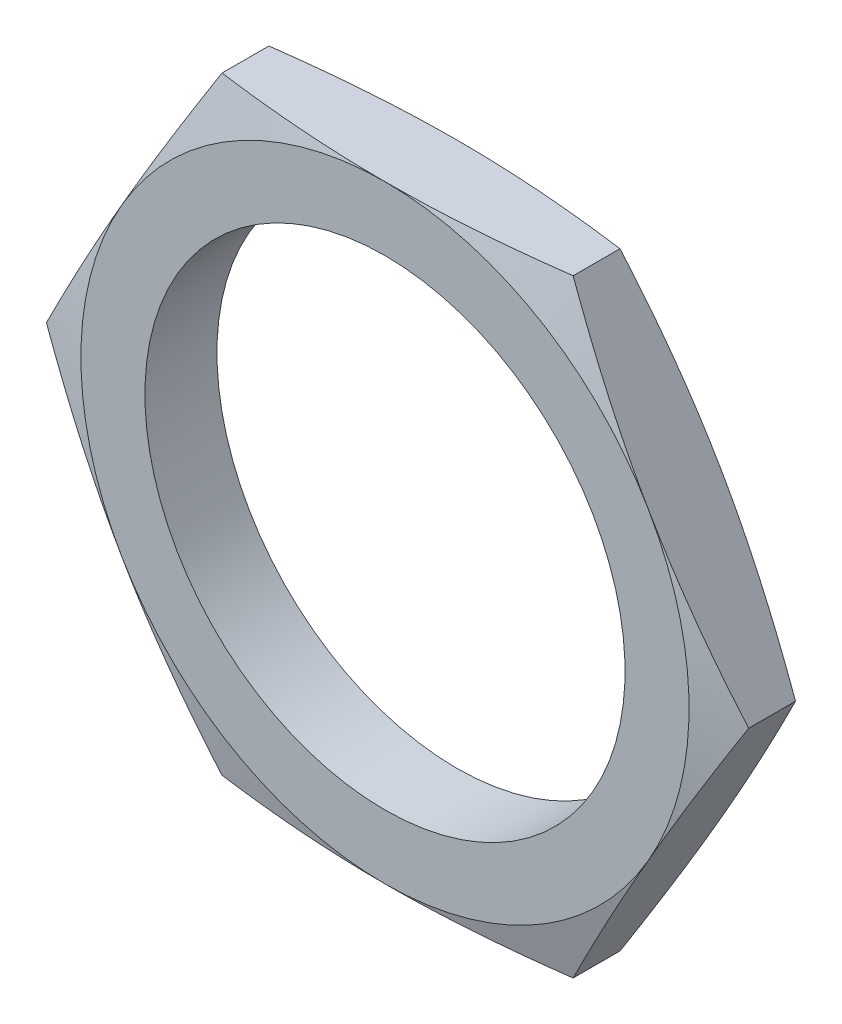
ISO-10303-21;
HEADER;
FILE_DESCRIPTION(('STEP AP214'),'2;1');
FILE_NAME('part.step','',(''),(''),'','','');
FILE_SCHEMA(('AUTOMOTIVE_DESIGN { 1 0 10303 214 1 1 1 1 }'));
ENDSEC;
DATA;
#1=APPLICATION_CONTEXT('core data for automotive mechanical design processes');
#2=APPLICATION_PROTOCOL_DEFINITION('international standard','automotive_design',2000,#1);
#3=PRODUCT_CONTEXT('',#1,'mechanical');
#4=PRODUCT('Part','Part','',(#3));
#5=PRODUCT_RELATED_PRODUCT_CATEGORY('part','',(#4));
#6=PRODUCT_DEFINITION_FORMATION('','',#4);
#7=PRODUCT_DEFINITION_CONTEXT('part definition',#1,'design');
#8=PRODUCT_DEFINITION('design','',#6,#7);
#9=PRODUCT_DEFINITION_SHAPE('','',#8);
#10=(LENGTH_UNIT() NAMED_UNIT(*) SI_UNIT(.MILLI.,.METRE.));
#11=(NAMED_UNIT(*) PLANE_ANGLE_UNIT() SI_UNIT($,.RADIAN.));
#12=(NAMED_UNIT(*) SI_UNIT($,.STERADIAN.) SOLID_ANGLE_UNIT());
#13=UNCERTAINTY_MEASURE_WITH_UNIT(LENGTH_MEASURE(1.E-05),#10,'distance_accuracy_value','');
#14=(GEOMETRIC_REPRESENTATION_CONTEXT(3) GLOBAL_UNCERTAINTY_ASSIGNED_CONTEXT((#13)) GLOBAL_UNIT_ASSIGNED_CONTEXT((#10,
#11,#12)) REPRESENTATION_CONTEXT('',''));
#15=CARTESIAN_POINT('',(0.,0.,0.));
#16=DIRECTION('',(0.,0.,1.));
#17=DIRECTION('',(1.,0.,0.));
#18=AXIS2_PLACEMENT_3D('',#15,#16,#17);
#19=CARTESIAN_POINT('',(60.,295.,13.));
#20=DIRECTION('',(0.,0.,1.));
#21=DIRECTION('',(0.,-1.,0.));
#22=AXIS2_PLACEMENT_3D('',#19,#20,#21);
#23=PLANE('',#22);
#24=CARTESIAN_POINT('',(60.,295.,13.));
#25=DIRECTION('',(0.,0.,-1.));
#26=DIRECTION('',(0.,1.,0.));
#27=AXIS2_PLACEMENT_3D('',#24,#25,#26);
#28=CIRCLE('',#27,7.60000000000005);
#29=CARTESIAN_POINT('',(60.,302.6,13.));
#30=VERTEX_POINT('',#29);
#31=CARTESIAN_POINT('',(53.4182069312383,298.8,13.));
#32=VERTEX_POINT('',#31);
#33=EDGE_CURVE('E158',#30,#32,#28,.F.);
#34=ORIENTED_EDGE('',*,*,#33,.T.);
#35=CARTESIAN_POINT('',(60.,295.,13.));
#36=DIRECTION('',(0.,0.,-1.));
#37=DIRECTION('',(0.,1.,0.));
#38=AXIS2_PLACEMENT_3D('',#35,#36,#37);
#39=CIRCLE('',#38,7.6);
#40=CARTESIAN_POINT('',(53.4182069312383,291.2,13.));
#41=VERTEX_POINT('',#40);
#42=EDGE_CURVE('E154',#32,#41,#39,.F.);
#43=ORIENTED_EDGE('',*,*,#42,.T.);
#44=CARTESIAN_POINT('',(60.,295.,13.));
#45=DIRECTION('',(0.,0.,-1.));
#46=DIRECTION('',(0.,1.,0.));
#47=AXIS2_PLACEMENT_3D('',#44,#45,#46);
#48=CIRCLE('',#47,7.59999999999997);
#49=CARTESIAN_POINT('',(60.,287.4,13.));
#50=VERTEX_POINT('',#49);
#51=EDGE_CURVE('E143',#41,#50,#48,.F.);
#52=ORIENTED_EDGE('',*,*,#51,.T.);
#53=CARTESIAN_POINT('',(60.,295.,13.));
#54=DIRECTION('',(0.,0.,-1.));
#55=DIRECTION('',(0.,1.,0.));
#56=AXIS2_PLACEMENT_3D('',#53,#54,#55);
#57=CIRCLE('',#56,7.6);
#58=CARTESIAN_POINT('',(66.5817930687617,291.2,13.));
#59=VERTEX_POINT('',#58);
#60=EDGE_CURVE('E149',#50,#59,#57,.F.);
#61=ORIENTED_EDGE('',*,*,#60,.T.);
#62=CARTESIAN_POINT('',(60.,295.,13.));
#63=DIRECTION('',(0.,0.,-1.));
#64=DIRECTION('',(0.,1.,0.));
#65=AXIS2_PLACEMENT_3D('',#62,#63,#64);
#66=CIRCLE('',#65,7.59999999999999);
#67=CARTESIAN_POINT('',(66.5817930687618,298.8,13.));
#68=VERTEX_POINT('',#67);
#69=EDGE_CURVE('E519',#59,#68,#66,.F.);
#70=ORIENTED_EDGE('',*,*,#69,.T.);
#71=CARTESIAN_POINT('',(60.,295.,13.));
#72=DIRECTION('',(0.,0.,-1.));
#73=DIRECTION('',(0.,1.,0.));
#74=AXIS2_PLACEMENT_3D('',#71,#72,#73);
#75=CIRCLE('',#74,7.59999999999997);
#76=EDGE_CURVE('E522',#68,#30,#75,.F.);
#77=ORIENTED_EDGE('',*,*,#76,.T.);
#78=EDGE_LOOP('',(#34,#43,#52,#61,#70,#77));
#79=FACE_BOUND('',#78,.T.);
#80=CARTESIAN_POINT('',(60.,295.,13.));
#81=DIRECTION('',(0.,0.,-1.));
#82=DIRECTION('',(0.,1.,0.));
#83=AXIS2_PLACEMENT_3D('',#80,#81,#82);
#84=CIRCLE('',#83,6.00000000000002);
#85=CARTESIAN_POINT('',(60.,301.,13.));
#86=VERTEX_POINT('',#85);
#87=EDGE_CURVE('E168',#86,#86,#84,.T.);
#88=ORIENTED_EDGE('',*,*,#87,.T.);
#89=EDGE_LOOP('',(#88));
#90=FACE_BOUND('',#89,.T.);
#91=ADVANCED_FACE('F38',(#79,#90),#23,.T.);
#92=CARTESIAN_POINT('',(60.,295.,13.));
#93=DIRECTION('',(0.,0.,-1.));
#94=DIRECTION('',(0.,1.,0.));
#95=AXIS2_PLACEMENT_3D('',#92,#93,#94);
#96=CONICAL_SURFACE('',#95,7.59999999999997,1.30899693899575);
#97=ORIENTED_EDGE('',*,*,#51,.F.);
#98=CARTESIAN_POINT('',(55.6121379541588,287.4,12.6849656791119));
#99=CARTESIAN_POINT('',(55.4302674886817,287.715008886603,12.7337204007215));
#100=CARTESIAN_POINT('',(55.2480606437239,288.030600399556,12.7779857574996));
#101=CARTESIAN_POINT('',(54.8832861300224,288.662408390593,12.8557208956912));
#102=CARTESIAN_POINT('',(54.7007191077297,288.978623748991,12.889202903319));
#103=CARTESIAN_POINT('',(54.4264957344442,289.453592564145,12.9300596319));
#104=CARTESIAN_POINT('',(54.3350130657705,289.612045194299,12.9421185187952));
#105=CARTESIAN_POINT('',(54.1519535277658,289.929113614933,12.9629380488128));
#106=CARTESIAN_POINT('',(54.0603766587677,290.087729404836,12.9716987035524));
#107=CARTESIAN_POINT('',(53.8770530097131,290.405255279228,12.9857840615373));
#108=CARTESIAN_POINT('',(53.7853061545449,290.564165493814,12.9911048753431));
#109=CARTESIAN_POINT('',(53.6017754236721,290.882050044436,12.9982181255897));
#110=CARTESIAN_POINT('',(53.5099915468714,291.04102438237,13.0000104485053));
#111=CARTESIAN_POINT('',(53.4182069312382,291.2,13.));
#112=B_SPLINE_CURVE_WITH_KNOTS('',3,(#98,#99,#100,#101,#102,#103,#104,#105,#106,#107,#108,#109,
#110,#111),.UNSPECIFIED.,.F.,.F.,(4,2,2,2,2,2,4),(0.,1.10106684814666,2.20088087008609,
2.7509407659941,3.30099872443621,3.85167755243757,4.40237409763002),.UNSPECIFIED.);
#113=CARTESIAN_POINT('',(55.6121379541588,287.4,12.6849656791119));
#114=VERTEX_POINT('',#113);
#115=EDGE_CURVE('E131',#114,#41,#112,.T.);
#116=ORIENTED_EDGE('',*,*,#115,.F.);
#117=CARTESIAN_POINT('',(60.,287.4,13.));
#118=CARTESIAN_POINT('',(59.8164307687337,287.4,13.0000104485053));
#119=CARTESIAN_POINT('',(59.6328630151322,287.4,12.9982181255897));
#120=CARTESIAN_POINT('',(59.2658015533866,287.4,12.9911048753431));
#121=CARTESIAN_POINT('',(59.0823078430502,287.4,12.9857840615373));
#122=CARTESIAN_POINT('',(58.7156605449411,287.4,12.9716987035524));
#123=CARTESIAN_POINT('',(58.5325068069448,287.4,12.9629380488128));
#124=CARTESIAN_POINT('',(58.1663877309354,287.4,12.9421185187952));
#125=CARTESIAN_POINT('',(57.9834223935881,287.4,12.9300596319));
#126=CARTESIAN_POINT('',(57.434975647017,287.4,12.889202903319));
#127=CARTESIAN_POINT('',(57.0698416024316,287.4,12.8557208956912));
#128=CARTESIAN_POINT('',(56.3402925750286,287.4,12.7779857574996));
#129=CARTESIAN_POINT('',(55.9758788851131,287.4,12.7337204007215));
#130=CARTESIAN_POINT('',(55.6121379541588,287.4,12.6849656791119));
#131=B_SPLINE_CURVE_WITH_KNOTS('',3,(#117,#118,#119,#120,#121,#122,#123,#124,#125,#126,#127,
#128,#129,#130),.UNSPECIFIED.,.F.,.F.,(4,2,2,2,2,2,4),(0.,0.550696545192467,1.10137537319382,
1.65143333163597,2.201493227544,3.30130724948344,4.40237409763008),.UNSPECIFIED.);
#132=EDGE_CURVE('E145',#50,#114,#131,.T.);
#133=ORIENTED_EDGE('',*,*,#132,.F.);
#134=EDGE_LOOP('',(#97,#116,#133));
#135=FACE_BOUND('',#134,.T.);
#136=ADVANCED_FACE('F40',(#135),#96,.T.);
#137=CARTESIAN_POINT('',(60.,295.,13.));
#138=DIRECTION('',(0.,0.,-1.));
#139=DIRECTION('',(0.,1.,0.));
#140=AXIS2_PLACEMENT_3D('',#137,#138,#139);
#141=CONICAL_SURFACE('',#140,7.59999999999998,1.30899693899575);
#142=ORIENTED_EDGE('',*,*,#60,.F.);
#143=CARTESIAN_POINT('',(64.3878620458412,287.4,12.6849656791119));
#144=CARTESIAN_POINT('',(64.0241211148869,287.4,12.7337204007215));
#145=CARTESIAN_POINT('',(63.6597074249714,287.4,12.7779857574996));
#146=CARTESIAN_POINT('',(62.9301583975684,287.4,12.8557208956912));
#147=CARTESIAN_POINT('',(62.565024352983,287.4,12.889202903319));
#148=CARTESIAN_POINT('',(62.0165776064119,287.4,12.9300596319));
#149=CARTESIAN_POINT('',(61.8336122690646,287.4,12.9421185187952));
#150=CARTESIAN_POINT('',(61.4674931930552,287.4,12.9629380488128));
#151=CARTESIAN_POINT('',(61.2843394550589,287.4,12.9716987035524));
#152=CARTESIAN_POINT('',(60.9176921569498,287.4,12.9857840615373));
#153=CARTESIAN_POINT('',(60.7341984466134,287.4,12.9911048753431));
#154=CARTESIAN_POINT('',(60.3671369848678,287.4,12.9982181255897));
#155=CARTESIAN_POINT('',(60.1835692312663,287.4,13.0000104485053));
#156=CARTESIAN_POINT('',(60.,287.4,13.));
#157=B_SPLINE_CURVE_WITH_KNOTS('',3,(#143,#144,#145,#146,#147,#148,#149,#150,#151,#152,#153,
#154,#155,#156),.UNSPECIFIED.,.F.,.F.,(4,2,2,2,2,2,4),(0.,1.10106684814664,2.20088087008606,
2.7509407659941,3.30099872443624,3.85167755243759,4.40237409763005),.UNSPECIFIED.);
#158=CARTESIAN_POINT('',(64.3878620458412,287.4,12.6849656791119));
#159=VERTEX_POINT('',#158);
#160=EDGE_CURVE('E141',#159,#50,#157,.T.);
#161=ORIENTED_EDGE('',*,*,#160,.F.);
#162=CARTESIAN_POINT('',(66.5817930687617,291.2,13.));
#163=CARTESIAN_POINT('',(66.4900084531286,291.04102438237,13.0000104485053));
#164=CARTESIAN_POINT('',(66.3982245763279,290.882050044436,12.9982181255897));
#165=CARTESIAN_POINT('',(66.2146938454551,290.564165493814,12.9911048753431));
#166=CARTESIAN_POINT('',(66.1229469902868,290.405255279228,12.9857840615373));
#167=CARTESIAN_POINT('',(65.9396233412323,290.087729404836,12.9716987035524));
#168=CARTESIAN_POINT('',(65.8480464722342,289.929113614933,12.9629380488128));
#169=CARTESIAN_POINT('',(65.6649869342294,289.612045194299,12.9421185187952));
#170=CARTESIAN_POINT('',(65.5735042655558,289.453592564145,12.9300596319));
#171=CARTESIAN_POINT('',(65.2992808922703,288.978623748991,12.889202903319));
#172=CARTESIAN_POINT('',(65.1167138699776,288.662408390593,12.8557208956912));
#173=CARTESIAN_POINT('',(64.7519393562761,288.030600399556,12.7779857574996));
#174=CARTESIAN_POINT('',(64.5697325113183,287.715008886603,12.7337204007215));
#175=CARTESIAN_POINT('',(64.3878620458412,287.4,12.6849656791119));
#176=B_SPLINE_CURVE_WITH_KNOTS('',3,(#162,#163,#164,#165,#166,#167,#168,#169,#170,#171,#172,
#173,#174,#175),.UNSPECIFIED.,.F.,.F.,(4,2,2,2,2,2,4),(0.,0.550696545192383,1.10137537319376,
1.65143333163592,2.20149322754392,3.30130724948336,4.40237409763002),.UNSPECIFIED.);
#177=EDGE_CURVE('E199',#59,#159,#176,.T.);
#178=ORIENTED_EDGE('',*,*,#177,.F.);
#179=EDGE_LOOP('',(#142,#161,#178));
#180=FACE_BOUND('',#179,.T.);
#181=ADVANCED_FACE('F484',(#180),#141,.T.);
#182=CARTESIAN_POINT('',(60.,295.,13.));
#183=DIRECTION('',(0.,0.,-1.));
#184=DIRECTION('',(0.,1.,0.));
#185=AXIS2_PLACEMENT_3D('',#182,#183,#184);
#186=CONICAL_SURFACE('',#185,7.59999999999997,1.30899693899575);
#187=ORIENTED_EDGE('',*,*,#69,.F.);
#188=CARTESIAN_POINT('',(68.7757240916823,295.,12.6849656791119));
#189=CARTESIAN_POINT('',(68.5938536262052,294.684991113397,12.7337204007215));
#190=CARTESIAN_POINT('',(68.4116467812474,294.369399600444,12.7779857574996));
#191=CARTESIAN_POINT('',(68.0468722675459,293.737591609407,12.8557208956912));
#192=CARTESIAN_POINT('',(67.8643052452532,293.421376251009,12.889202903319));
#193=CARTESIAN_POINT('',(67.5900818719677,292.946407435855,12.9300596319));
#194=CARTESIAN_POINT('',(67.498599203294,292.787954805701,12.9421185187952));
#195=CARTESIAN_POINT('',(67.3155396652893,292.470886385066,12.9629380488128));
#196=CARTESIAN_POINT('',(67.2239627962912,292.312270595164,12.9716987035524));
#197=CARTESIAN_POINT('',(67.0406391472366,291.994744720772,12.9857840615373));
#198=CARTESIAN_POINT('',(66.9488922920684,291.835834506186,12.9911048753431));
#199=CARTESIAN_POINT('',(66.7653615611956,291.517949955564,12.9982181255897));
#200=CARTESIAN_POINT('',(66.6735776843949,291.35897561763,13.0000104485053));
#201=CARTESIAN_POINT('',(66.5817930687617,291.2,13.));
#202=B_SPLINE_CURVE_WITH_KNOTS('',3,(#188,#189,#190,#191,#192,#193,#194,#195,#196,#197,#198,
#199,#200,#201),.UNSPECIFIED.,.F.,.F.,(4,2,2,2,2,2,4),(0.,1.1010668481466,2.2008808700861,
2.7509407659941,3.30099872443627,3.85167755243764,4.40237409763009),.UNSPECIFIED.);
#203=CARTESIAN_POINT('',(68.7757240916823,295.,12.6849656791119));
#204=VERTEX_POINT('',#203);
#205=EDGE_CURVE('E201',#204,#59,#202,.T.);
#206=ORIENTED_EDGE('',*,*,#205,.F.);
#207=CARTESIAN_POINT('',(66.5817930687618,298.8,13.));
#208=CARTESIAN_POINT('',(66.673577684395,298.64102438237,13.0000104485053));
#209=CARTESIAN_POINT('',(66.7653615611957,298.482050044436,12.9982181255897));
#210=CARTESIAN_POINT('',(66.9488922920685,298.164165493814,12.9911048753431));
#211=CARTESIAN_POINT('',(67.0406391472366,298.005255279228,12.9857840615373));
#212=CARTESIAN_POINT('',(67.2239627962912,297.687729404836,12.9716987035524));
#213=CARTESIAN_POINT('',(67.3155396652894,297.529113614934,12.9629380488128));
#214=CARTESIAN_POINT('',(67.4985992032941,297.212045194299,12.9421185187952));
#215=CARTESIAN_POINT('',(67.5900818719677,297.053592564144,12.9300596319));
#216=CARTESIAN_POINT('',(67.8643052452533,296.578623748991,12.889202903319));
#217=CARTESIAN_POINT('',(68.046872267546,296.262408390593,12.8557208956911));
#218=CARTESIAN_POINT('',(68.4116467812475,295.630600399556,12.7779857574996));
#219=CARTESIAN_POINT('',(68.5938536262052,295.315008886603,12.7337204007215));
#220=CARTESIAN_POINT('',(68.7757240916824,295.,12.6849656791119));
#221=B_SPLINE_CURVE_WITH_KNOTS('',3,(#207,#208,#209,#210,#211,#212,#213,#214,#215,#216,#217,
#218,#219,#220),.UNSPECIFIED.,.F.,.F.,(4,2,2,2,2,2,4),(0.,0.550696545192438,1.1013753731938,
1.65143333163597,2.20149322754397,3.30130724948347,4.40237409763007),.UNSPECIFIED.);
#222=EDGE_CURVE('E194',#68,#204,#221,.T.);
#223=ORIENTED_EDGE('',*,*,#222,.F.);
#224=EDGE_LOOP('',(#187,#206,#223));
#225=FACE_BOUND('',#224,.T.);
#226=ADVANCED_FACE('F333',(#225),#186,.T.);
#227=CARTESIAN_POINT('',(60.,295.,13.));
#228=DIRECTION('',(0.,0.,-1.));
#229=DIRECTION('',(0.,1.,0.));
#230=AXIS2_PLACEMENT_3D('',#227,#228,#229);
#231=CONICAL_SURFACE('',#230,7.59999999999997,1.30899693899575);
#232=CARTESIAN_POINT('',(60.,302.6,13.));
#233=CARTESIAN_POINT('',(60.1835692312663,302.6,13.0000104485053));
#234=CARTESIAN_POINT('',(60.3671369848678,302.6,12.9982181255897));
#235=CARTESIAN_POINT('',(60.7341984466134,302.6,12.9911048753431));
#236=CARTESIAN_POINT('',(60.9176921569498,302.6,12.9857840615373));
#237=CARTESIAN_POINT('',(61.2843394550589,302.6,12.9716987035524));
#238=CARTESIAN_POINT('',(61.4674931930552,302.6,12.9629380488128));
#239=CARTESIAN_POINT('',(61.8336122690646,302.6,12.9421185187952));
#240=CARTESIAN_POINT('',(62.0165776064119,302.6,12.9300596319));
#241=CARTESIAN_POINT('',(62.565024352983,302.6,12.889202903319));
#242=CARTESIAN_POINT('',(62.9301583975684,302.6,12.8557208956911));
#243=CARTESIAN_POINT('',(63.6597074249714,302.6,12.7779857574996));
#244=CARTESIAN_POINT('',(64.0241211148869,302.6,12.7337204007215));
#245=CARTESIAN_POINT('',(64.3878620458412,302.6,12.6849656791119));
#246=B_SPLINE_CURVE_WITH_KNOTS('',3,(#232,#233,#234,#235,#236,#237,#238,#239,#240,#241,#242,
#243,#244,#245),.UNSPECIFIED.,.F.,.F.,(4,2,2,2,2,2,4),(0.,0.550696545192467,1.10137537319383,
1.65143333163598,2.20149322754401,3.30130724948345,4.4023740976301),.UNSPECIFIED.);
#247=CARTESIAN_POINT('',(64.3878620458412,302.6,12.6849656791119));
#248=VERTEX_POINT('',#247);
#249=EDGE_CURVE('E186',#30,#248,#246,.T.);
#250=ORIENTED_EDGE('',*,*,#249,.F.);
#251=ORIENTED_EDGE('',*,*,#76,.F.);
#252=CARTESIAN_POINT('',(64.3878620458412,302.6,12.6849656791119));
#253=CARTESIAN_POINT('',(64.5697325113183,302.284991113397,12.7337204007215));
#254=CARTESIAN_POINT('',(64.7519393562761,301.969399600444,12.7779857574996));
#255=CARTESIAN_POINT('',(65.1167138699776,301.337591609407,12.8557208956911));
#256=CARTESIAN_POINT('',(65.2992808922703,301.021376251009,12.889202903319));
#257=CARTESIAN_POINT('',(65.5735042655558,300.546407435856,12.9300596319));
#258=CARTESIAN_POINT('',(65.6649869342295,300.387954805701,12.9421185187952));
#259=CARTESIAN_POINT('',(65.8480464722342,300.070886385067,12.9629380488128));
#260=CARTESIAN_POINT('',(65.9396233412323,299.912270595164,12.9716987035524));
#261=CARTESIAN_POINT('',(66.1229469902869,299.594744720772,12.9857840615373));
#262=CARTESIAN_POINT('',(66.2146938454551,299.435834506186,12.9911048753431));
#263=CARTESIAN_POINT('',(66.3982245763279,299.117949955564,12.9982181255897));
#264=CARTESIAN_POINT('',(66.4900084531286,298.95897561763,13.0000104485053));
#265=CARTESIAN_POINT('',(66.5817930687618,298.8,13.));
#266=B_SPLINE_CURVE_WITH_KNOTS('',3,(#252,#253,#254,#255,#256,#257,#258,#259,#260,#261,#262,
#263,#264,#265),.UNSPECIFIED.,.F.,.F.,(4,2,2,2,2,2,4),(0.,1.10106684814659,2.20088087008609,
2.7509407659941,3.30099872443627,3.85167755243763,4.40237409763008),.UNSPECIFIED.);
#267=EDGE_CURVE('E198',#248,#68,#266,.T.);
#268=ORIENTED_EDGE('',*,*,#267,.F.);
#269=EDGE_LOOP('',(#250,#251,#268));
#270=FACE_BOUND('',#269,.T.);
#271=ADVANCED_FACE('F329',(#270),#231,.T.);
#272=CARTESIAN_POINT('',(60.,295.,13.));
#273=DIRECTION('',(0.,0.,-1.));
#274=DIRECTION('',(0.,1.,0.));
#275=AXIS2_PLACEMENT_3D('',#272,#273,#274);
#276=CONICAL_SURFACE('',#275,7.6,1.30899693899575);
#277=CARTESIAN_POINT('',(53.4182069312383,298.8,13.));
#278=CARTESIAN_POINT('',(53.5099915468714,298.95897561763,13.0000104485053));
#279=CARTESIAN_POINT('',(53.6017754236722,299.117949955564,12.9982181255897));
#280=CARTESIAN_POINT('',(53.785306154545,299.435834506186,12.9911048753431));
#281=CARTESIAN_POINT('',(53.8770530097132,299.594744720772,12.9857840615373));
#282=CARTESIAN_POINT('',(54.0603766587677,299.912270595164,12.9716987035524));
#283=CARTESIAN_POINT('',(54.1519535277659,300.070886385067,12.9629380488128));
#284=CARTESIAN_POINT('',(54.3350130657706,300.387954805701,12.9421185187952));
#285=CARTESIAN_POINT('',(54.4264957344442,300.546407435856,12.9300596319));
#286=CARTESIAN_POINT('',(54.7007191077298,301.021376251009,12.889202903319));
#287=CARTESIAN_POINT('',(54.8832861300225,301.337591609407,12.8557208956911));
#288=CARTESIAN_POINT('',(55.248060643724,301.969399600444,12.7779857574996));
#289=CARTESIAN_POINT('',(55.4302674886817,302.284991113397,12.7337204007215));
#290=CARTESIAN_POINT('',(55.6121379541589,302.6,12.6849656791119));
#291=B_SPLINE_CURVE_WITH_KNOTS('',3,(#277,#278,#279,#280,#281,#282,#283,#284,#285,#286,#287,
#288,#289,#290),.UNSPECIFIED.,.F.,.F.,(4,2,2,2,2,2,4),(0.,0.550696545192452,1.10137537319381,
1.65143333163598,2.20149322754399,3.30130724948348,4.40237409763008),.UNSPECIFIED.);
#292=CARTESIAN_POINT('',(55.6121379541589,302.6,12.6849656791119));
#293=VERTEX_POINT('',#292);
#294=EDGE_CURVE('E190',#32,#293,#291,.T.);
#295=ORIENTED_EDGE('',*,*,#294,.F.);
#296=ORIENTED_EDGE('',*,*,#33,.F.);
#297=CARTESIAN_POINT('',(55.6121379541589,302.6,12.6849656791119));
#298=CARTESIAN_POINT('',(55.9758788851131,302.6,12.7337204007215));
#299=CARTESIAN_POINT('',(56.3402925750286,302.6,12.7779857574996));
#300=CARTESIAN_POINT('',(57.0698416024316,302.6,12.8557208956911));
#301=CARTESIAN_POINT('',(57.4349756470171,302.6,12.889202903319));
#302=CARTESIAN_POINT('',(57.9834223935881,302.6,12.9300596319));
#303=CARTESIAN_POINT('',(58.1663877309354,302.6,12.9421185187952));
#304=CARTESIAN_POINT('',(58.5325068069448,302.6,12.9629380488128));
#305=CARTESIAN_POINT('',(58.7156605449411,302.6,12.9716987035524));
#306=CARTESIAN_POINT('',(59.0823078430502,302.6,12.9857840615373));
#307=CARTESIAN_POINT('',(59.2658015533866,302.6,12.991104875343));
#308=CARTESIAN_POINT('',(59.6328630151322,302.6,12.9982181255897));
#309=CARTESIAN_POINT('',(59.8164307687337,302.6,13.0000104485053));
#310=CARTESIAN_POINT('',(60.,302.6,13.));
#311=B_SPLINE_CURVE_WITH_KNOTS('',3,(#297,#298,#299,#300,#301,#302,#303,#304,#305,#306,#307,
#308,#309,#310),.UNSPECIFIED.,.F.,.F.,(4,2,2,2,2,2,4),(0.,1.10106684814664,2.20088087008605,
2.75094076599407,3.30099872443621,3.85167755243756,4.40237409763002),.UNSPECIFIED.);
#312=EDGE_CURVE('E150',#293,#30,#311,.T.);
#313=ORIENTED_EDGE('',*,*,#312,.F.);
#314=EDGE_LOOP('',(#295,#296,#313));
#315=FACE_BOUND('',#314,.T.);
#316=ADVANCED_FACE('F332',(#315),#276,.T.);
#317=CARTESIAN_POINT('',(60.,295.,13.));
#318=DIRECTION('',(0.,0.,-1.));
#319=DIRECTION('',(0.,1.,0.));
#320=AXIS2_PLACEMENT_3D('',#317,#318,#319);
#321=CONICAL_SURFACE('',#320,7.59999999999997,1.30899693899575);
#322=CARTESIAN_POINT('',(53.4182069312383,291.2,13.));
#323=CARTESIAN_POINT('',(53.3264223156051,291.35897561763,13.0000104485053));
#324=CARTESIAN_POINT('',(53.2346384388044,291.517949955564,12.9982181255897));
#325=CARTESIAN_POINT('',(53.0511077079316,291.835834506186,12.9911048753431));
#326=CARTESIAN_POINT('',(52.9593608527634,291.994744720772,12.9857840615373));
#327=CARTESIAN_POINT('',(52.7760372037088,292.312270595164,12.9716987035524));
#328=CARTESIAN_POINT('',(52.6844603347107,292.470886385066,12.9629380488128));
#329=CARTESIAN_POINT('',(52.501400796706,292.787954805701,12.9421185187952));
#330=CARTESIAN_POINT('',(52.4099181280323,292.946407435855,12.9300596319));
#331=CARTESIAN_POINT('',(52.1356947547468,293.421376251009,12.889202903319));
#332=CARTESIAN_POINT('',(51.953127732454,293.737591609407,12.8557208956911));
#333=CARTESIAN_POINT('',(51.5883532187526,294.369399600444,12.7779857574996));
#334=CARTESIAN_POINT('',(51.4061463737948,294.684991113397,12.7337204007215));
#335=CARTESIAN_POINT('',(51.2242759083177,295.,12.6849656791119));
#336=B_SPLINE_CURVE_WITH_KNOTS('',3,(#322,#323,#324,#325,#326,#327,#328,#329,#330,#331,#332,
#333,#334,#335),.UNSPECIFIED.,.F.,.F.,(4,2,2,2,2,2,4),(0.,0.550696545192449,1.10137537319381,
1.65143333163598,2.20149322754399,3.30130724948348,4.40237409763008),.UNSPECIFIED.);
#337=CARTESIAN_POINT('',(51.2242759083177,295.,12.6849656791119));
#338=VERTEX_POINT('',#337);
#339=EDGE_CURVE('E43',#41,#338,#336,.T.);
#340=ORIENTED_EDGE('',*,*,#339,.F.);
#341=ORIENTED_EDGE('',*,*,#42,.F.);
#342=CARTESIAN_POINT('',(51.2242759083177,295.,12.6849656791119));
#343=CARTESIAN_POINT('',(51.4061463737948,295.315008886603,12.7337204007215));
#344=CARTESIAN_POINT('',(51.5883532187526,295.630600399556,12.7779857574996));
#345=CARTESIAN_POINT('',(51.9531277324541,296.262408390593,12.8557208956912));
#346=CARTESIAN_POINT('',(52.1356947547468,296.578623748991,12.889202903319));
#347=CARTESIAN_POINT('',(52.4099181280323,297.053592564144,12.9300596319));
#348=CARTESIAN_POINT('',(52.501400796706,297.212045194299,12.9421185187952));
#349=CARTESIAN_POINT('',(52.6844603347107,297.529113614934,12.9629380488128));
#350=CARTESIAN_POINT('',(52.7760372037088,297.687729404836,12.9716987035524));
#351=CARTESIAN_POINT('',(52.9593608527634,298.005255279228,12.9857840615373));
#352=CARTESIAN_POINT('',(53.0511077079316,298.164165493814,12.9911048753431));
#353=CARTESIAN_POINT('',(53.2346384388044,298.482050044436,12.9982181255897));
#354=CARTESIAN_POINT('',(53.3264223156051,298.64102438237,13.0000104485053));
#355=CARTESIAN_POINT('',(53.4182069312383,298.8,13.));
#356=B_SPLINE_CURVE_WITH_KNOTS('',3,(#342,#343,#344,#345,#346,#347,#348,#349,#350,#351,#352,
#353,#354,#355),.UNSPECIFIED.,.F.,.F.,(4,2,2,2,2,2,4),(0.,1.1010668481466,2.20088087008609,
2.75094076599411,3.30099872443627,3.85167755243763,4.40237409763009),.UNSPECIFIED.);
#357=EDGE_CURVE('E166',#338,#32,#356,.T.);
#358=ORIENTED_EDGE('',*,*,#357,.F.);
#359=EDGE_LOOP('',(#340,#341,#358));
#360=FACE_BOUND('',#359,.T.);
#361=ADVANCED_FACE('F165',(#360),#321,.T.);
#362=CARTESIAN_POINT('',(55.6121379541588,287.4,11.1999999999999));
#363=DIRECTION('',(-0.866025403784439,-0.5,0.));
#364=DIRECTION('',(0.5,-0.866025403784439,0.));
#365=AXIS2_PLACEMENT_3D('',#362,#363,#364);
#366=PLANE('',#365);
#367=DIRECTION('',(0.,0.,1.));
#368=VECTOR('',#367,1.);
#369=CARTESIAN_POINT('',(55.6121379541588,287.4,11.1999999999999));
#370=LINE('',#369,#368);
#371=CARTESIAN_POINT('',(55.6121379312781,287.4,11.5150343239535));
#372=VERTEX_POINT('',#371);
#373=EDGE_CURVE('E137',#114,#372,#370,.F.);
#374=ORIENTED_EDGE('',*,*,#373,.F.);
#375=ORIENTED_EDGE('',*,*,#115,.T.);
#376=ORIENTED_EDGE('',*,*,#339,.T.);
#377=DIRECTION('',(0.,0.,1.));
#378=VECTOR('',#377,1.);
#379=CARTESIAN_POINT('',(51.2242759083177,295.,11.1999999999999));
#380=LINE('',#379,#378);
#381=CARTESIAN_POINT('',(51.2242758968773,295.000000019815,11.5150343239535));
#382=VERTEX_POINT('',#381);
#383=EDGE_CURVE('E187',#382,#338,#380,.T.);
#384=ORIENTED_EDGE('',*,*,#383,.F.);
#385=CARTESIAN_POINT('',(51.224275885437,295.00000003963,11.5150343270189));
#386=CARTESIAN_POINT('',(51.4061463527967,294.684991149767,11.4662796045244));
#387=CARTESIAN_POINT('',(51.5883531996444,294.36939963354,11.4220142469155));
#388=CARTESIAN_POINT('',(51.953127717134,293.737591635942,11.3442791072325));
#389=CARTESIAN_POINT('',(52.135694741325,293.421376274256,11.3107970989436));
#390=CARTESIAN_POINT('',(52.4099181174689,292.946407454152,11.269940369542));
#391=CARTESIAN_POINT('',(52.5014007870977,292.787954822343,11.2578814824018));
#392=CARTESIAN_POINT('',(52.6844603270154,292.470886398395,11.2370619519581));
#393=CARTESIAN_POINT('',(52.7760371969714,292.312270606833,11.2283012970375));
#394=CARTESIAN_POINT('',(52.9593608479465,291.994744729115,11.2142159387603));
#395=CARTESIAN_POINT('',(53.0511077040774,291.835834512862,11.2088951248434));
#396=CARTESIAN_POINT('',(53.2346384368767,291.517949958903,11.2017818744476));
#397=CARTESIAN_POINT('',(53.3264223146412,291.358975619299,11.1999895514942));
#398=CARTESIAN_POINT('',(53.4182069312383,291.2,11.2));
#399=B_SPLINE_CURVE_WITH_KNOTS('',3,(#385,#386,#387,#388,#389,#390,#391,#392,#393,#394,#395,
#396,#397,#398),.UNSPECIFIED.,.F.,.F.,(4,2,2,2,2,2,4),(0.,1.10106685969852,2.20088089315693,
2.75094079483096,3.30099875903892,3.85167759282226,4.40237414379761),.UNSPECIFIED.);
#400=CARTESIAN_POINT('',(53.4182069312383,291.2,11.2));
#401=VERTEX_POINT('',#400);
#402=EDGE_CURVE('E371',#382,#401,#399,.T.);
#403=ORIENTED_EDGE('',*,*,#402,.T.);
#404=CARTESIAN_POINT('',(53.4182069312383,291.2,11.2));
#405=CARTESIAN_POINT('',(53.509991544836,291.041024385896,11.1999895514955));
#406=CARTESIAN_POINT('',(53.6017754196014,290.882050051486,11.2017818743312));
#407=CARTESIAN_POINT('',(53.7853061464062,290.564165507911,11.208895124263));
#408=CARTESIAN_POINT('',(53.8770529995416,290.405255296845,11.2142159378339));
#409=CARTESIAN_POINT('',(54.0603766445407,290.087729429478,11.2283012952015));
#410=CARTESIAN_POINT('',(54.1519535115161,289.929113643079,11.2370619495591));
#411=CARTESIAN_POINT('',(54.3350130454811,289.612045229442,11.2578814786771));
#412=CARTESIAN_POINT('',(54.4264957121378,289.45359260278,11.2699403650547));
#413=CARTESIAN_POINT('',(54.7007190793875,288.978623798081,11.310797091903));
#414=CARTESIAN_POINT('',(54.8832860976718,288.662408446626,11.344279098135));
#415=CARTESIAN_POINT('',(55.248060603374,288.030600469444,11.4220142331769));
#416=CARTESIAN_POINT('',(55.430267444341,287.715008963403,11.4662795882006));
#417=CARTESIAN_POINT('',(55.6121379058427,287.400000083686,11.5150343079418));
#418=B_SPLINE_CURVE_WITH_KNOTS('',3,(#404,#405,#406,#407,#408,#409,#410,#411,#412,#413,#414,
#415,#416,#417),.UNSPECIFIED.,.F.,.F.,(4,2,2,2,2,2,4),(0.,0.550696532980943,1.10137534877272,
1.65143329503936,2.20149317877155,3.30130717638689,4.40237400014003),.UNSPECIFIED.);
#419=EDGE_CURVE('E365',#401,#372,#418,.T.);
#420=ORIENTED_EDGE('',*,*,#419,.T.);
#421=EDGE_LOOP('',(#374,#375,#376,#384,#403,#420));
#422=FACE_BOUND('',#421,.T.);
#423=ADVANCED_FACE('F133',(#422),#366,.T.);
#424=CARTESIAN_POINT('',(64.3878620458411,287.4,11.1999999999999));
#425=DIRECTION('',(0.,-1.,0.));
#426=DIRECTION('',(1.,0.,0.));
#427=AXIS2_PLACEMENT_3D('',#424,#425,#426);
#428=PLANE('',#427);
#429=CARTESIAN_POINT('',(60.,287.4,11.2));
#430=CARTESIAN_POINT('',(60.1835692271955,287.4,11.1999895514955));
#431=CARTESIAN_POINT('',(60.3671369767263,287.4,11.2017818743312));
#432=CARTESIAN_POINT('',(60.7341984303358,287.4,11.208895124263));
#433=CARTESIAN_POINT('',(60.9176921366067,287.4,11.2142159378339));
#434=CARTESIAN_POINT('',(61.2843394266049,287.4,11.2283012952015));
#435=CARTESIAN_POINT('',(61.4674931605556,287.4,11.2370619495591));
#436=CARTESIAN_POINT('',(61.8336122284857,287.4,11.2578814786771));
#437=CARTESIAN_POINT('',(62.0165775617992,287.4,11.2699403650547));
#438=CARTESIAN_POINT('',(62.5650242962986,287.4,11.310797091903));
#439=CARTESIAN_POINT('',(62.930158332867,287.4,11.344279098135));
#440=CARTESIAN_POINT('',(63.6597073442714,287.4,11.4220142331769));
#441=CARTESIAN_POINT('',(64.0241210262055,287.4,11.4662795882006));
#442=CARTESIAN_POINT('',(64.3878619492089,287.4,11.5150343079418));
#443=B_SPLINE_CURVE_WITH_KNOTS('',3,(#429,#430,#431,#432,#433,#434,#435,#436,#437,#438,#439,
#440,#441,#442),.UNSPECIFIED.,.F.,.F.,(4,2,2,2,2,2,4),(0.,0.550696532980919,1.10137534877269,
1.65143329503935,2.20149317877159,3.3013071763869,4.40237400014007),.UNSPECIFIED.);
#444=CARTESIAN_POINT('',(60.,287.4,11.2));
#445=VERTEX_POINT('',#444);
#446=CARTESIAN_POINT('',(64.3878620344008,287.399999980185,11.5150343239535));
#447=VERTEX_POINT('',#446);
#448=EDGE_CURVE('E396',#445,#447,#443,.T.);
#449=ORIENTED_EDGE('',*,*,#448,.T.);
#450=DIRECTION('',(0.,0.,1.));
#451=VECTOR('',#450,1.);
#452=CARTESIAN_POINT('',(64.3878620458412,287.4,11.1999999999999));
#453=LINE('',#452,#451);
#454=EDGE_CURVE('E195',#159,#447,#453,.F.);
#455=ORIENTED_EDGE('',*,*,#454,.F.);
#456=ORIENTED_EDGE('',*,*,#160,.T.);
#457=ORIENTED_EDGE('',*,*,#132,.T.);
#458=ORIENTED_EDGE('',*,*,#373,.T.);
#459=CARTESIAN_POINT('',(55.6121379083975,287.4,11.5150343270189));
#460=CARTESIAN_POINT('',(55.9758788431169,287.4,11.4662796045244));
#461=CARTESIAN_POINT('',(56.3402925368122,287.4,11.4220142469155));
#462=CARTESIAN_POINT('',(57.0698415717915,287.4,11.3442791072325));
#463=CARTESIAN_POINT('',(57.4349756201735,287.4,11.3107970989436));
#464=CARTESIAN_POINT('',(57.9834223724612,287.4,11.269940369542));
#465=CARTESIAN_POINT('',(58.1663877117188,287.4,11.2578814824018));
#466=CARTESIAN_POINT('',(58.5325067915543,287.4,11.2370619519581));
#467=CARTESIAN_POINT('',(58.7156605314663,287.4,11.2283012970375));
#468=CARTESIAN_POINT('',(59.0823078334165,287.4,11.2142159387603));
#469=CARTESIAN_POINT('',(59.2658015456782,287.4,11.2088951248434));
#470=CARTESIAN_POINT('',(59.6328630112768,287.4,11.2017818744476));
#471=CARTESIAN_POINT('',(59.8164307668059,287.4,11.1999895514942));
#472=CARTESIAN_POINT('',(60.,287.4,11.2));
#473=B_SPLINE_CURVE_WITH_KNOTS('',3,(#459,#460,#461,#462,#463,#464,#465,#466,#467,#468,#469,
#470,#471,#472),.UNSPECIFIED.,.F.,.F.,(4,2,2,2,2,2,4),(0.,1.10106685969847,2.20088089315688,
2.75094079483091,3.30099875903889,3.85167759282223,4.40237414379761),.UNSPECIFIED.);
#474=EDGE_CURVE('E390',#372,#445,#473,.T.);
#475=ORIENTED_EDGE('',*,*,#474,.T.);
#476=EDGE_LOOP('',(#449,#455,#456,#457,#458,#475));
#477=FACE_BOUND('',#476,.T.);
#478=ADVANCED_FACE('F355',(#477),#428,.T.);
#479=CARTESIAN_POINT('',(68.7757240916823,295.,11.1999999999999));
#480=DIRECTION('',(0.866025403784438,-0.500000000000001,0.));
#481=DIRECTION('',(0.500000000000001,0.866025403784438,0.));
#482=AXIS2_PLACEMENT_3D('',#479,#480,#481);
#483=PLANE('',#482);
#484=CARTESIAN_POINT('',(66.5817930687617,291.2,11.2));
#485=CARTESIAN_POINT('',(66.6735776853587,291.358975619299,11.1999895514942));
#486=CARTESIAN_POINT('',(66.7653615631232,291.517949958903,11.2017818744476));
#487=CARTESIAN_POINT('',(66.9488922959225,291.835834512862,11.2088951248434));
#488=CARTESIAN_POINT('',(67.0406391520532,291.994744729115,11.2142159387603));
#489=CARTESIAN_POINT('',(67.2239628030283,292.312270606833,11.2283012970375));
#490=CARTESIAN_POINT('',(67.3155396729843,292.470886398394,11.2370619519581));
#491=CARTESIAN_POINT('',(67.4985992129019,292.787954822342,11.2578814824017));
#492=CARTESIAN_POINT('',(67.5900818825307,292.946407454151,11.2699403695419));
#493=CARTESIAN_POINT('',(67.8643052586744,293.421376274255,11.3107970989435));
#494=CARTESIAN_POINT('',(68.0468722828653,293.73759163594,11.3442791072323));
#495=CARTESIAN_POINT('',(68.4116468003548,294.369399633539,11.4220142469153));
#496=CARTESIAN_POINT('',(68.5938536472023,294.684991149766,11.4662796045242));
#497=CARTESIAN_POINT('',(68.775724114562,295.000000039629,11.5150343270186));
#498=B_SPLINE_CURVE_WITH_KNOTS('',3,(#484,#485,#486,#487,#488,#489,#490,#491,#492,#493,#494,
#495,#496,#497),.UNSPECIFIED.,.F.,.F.,(4,2,2,2,2,2,4),(0.,0.550696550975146,1.10137538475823,
1.65143334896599,2.20149325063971,3.3013072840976,4.40237414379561),.UNSPECIFIED.);
#499=CARTESIAN_POINT('',(66.5817930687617,291.2,11.2));
#500=VERTEX_POINT('',#499);
#501=CARTESIAN_POINT('',(68.7757240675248,295.000000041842,11.5150343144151));
#502=VERTEX_POINT('',#501);
#503=EDGE_CURVE('E266',#500,#502,#498,.T.);
#504=ORIENTED_EDGE('',*,*,#503,.T.);
#505=DIRECTION('',(0.,0.,1.));
#506=VECTOR('',#505,1.);
#507=CARTESIAN_POINT('',(68.7757240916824,295.,11.1999999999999));
#508=LINE('',#507,#506);
#509=EDGE_CURVE('E191',#204,#502,#508,.F.);
#510=ORIENTED_EDGE('',*,*,#509,.F.);
#511=ORIENTED_EDGE('',*,*,#205,.T.);
#512=ORIENTED_EDGE('',*,*,#177,.T.);
#513=ORIENTED_EDGE('',*,*,#454,.T.);
#514=CARTESIAN_POINT('',(64.3878620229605,287.39999996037,11.5150343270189));
#515=CARTESIAN_POINT('',(64.5697324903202,287.715008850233,11.4662796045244));
#516=CARTESIAN_POINT('',(64.7519393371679,288.03060036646,11.4220142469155));
#517=CARTESIAN_POINT('',(65.1167138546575,288.662408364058,11.3442791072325));
#518=CARTESIAN_POINT('',(65.2992808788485,288.978623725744,11.3107970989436));
#519=CARTESIAN_POINT('',(65.5735042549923,289.453592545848,11.269940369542));
#520=CARTESIAN_POINT('',(65.6649869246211,289.612045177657,11.2578814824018));
#521=CARTESIAN_POINT('',(65.8480464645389,289.929113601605,11.2370619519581));
#522=CARTESIAN_POINT('',(65.9396233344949,290.087729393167,11.2283012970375));
#523=CARTESIAN_POINT('',(66.12294698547,290.405255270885,11.2142159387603));
#524=CARTESIAN_POINT('',(66.2146938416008,290.564165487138,11.2088951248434));
#525=CARTESIAN_POINT('',(66.3982245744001,290.882050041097,11.2017818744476));
#526=CARTESIAN_POINT('',(66.4900084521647,291.041024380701,11.1999895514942));
#527=CARTESIAN_POINT('',(66.5817930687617,291.2,11.2));
#528=B_SPLINE_CURVE_WITH_KNOTS('',3,(#514,#515,#516,#517,#518,#519,#520,#521,#522,#523,#524,
#525,#526,#527),.UNSPECIFIED.,.F.,.F.,(4,2,2,2,2,2,4),(0.,1.10106685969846,2.20088089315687,
2.75094079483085,3.30099875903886,3.85167759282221,4.40237414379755),.UNSPECIFIED.);
#529=EDGE_CURVE('E297',#447,#500,#528,.T.);
#530=ORIENTED_EDGE('',*,*,#529,.T.);
#531=EDGE_LOOP('',(#504,#510,#511,#512,#513,#530));
#532=FACE_BOUND('',#531,.T.);
#533=ADVANCED_FACE('F305',(#532),#483,.T.);
#534=CARTESIAN_POINT('',(64.3878620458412,302.6,11.1999999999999));
#535=DIRECTION('',(0.86602540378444,0.499999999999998,0.));
#536=DIRECTION('',(-0.499999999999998,0.86602540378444,0.));
#537=AXIS2_PLACEMENT_3D('',#534,#535,#536);
#538=PLANE('',#537);
#539=CARTESIAN_POINT('',(66.5817930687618,298.8,11.2));
#540=CARTESIAN_POINT('',(66.4900084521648,298.958975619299,11.1999895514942));
#541=CARTESIAN_POINT('',(66.3982245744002,299.117949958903,11.2017818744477));
#542=CARTESIAN_POINT('',(66.2146938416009,299.435834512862,11.2088951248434));
#543=CARTESIAN_POINT('',(66.1229469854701,299.594744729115,11.2142159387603));
#544=CARTESIAN_POINT('',(65.939623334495,299.912270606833,11.2283012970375));
#545=CARTESIAN_POINT('',(65.8480464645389,300.070886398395,11.2370619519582));
#546=CARTESIAN_POINT('',(65.6649869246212,300.387954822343,11.2578814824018));
#547=CARTESIAN_POINT('',(65.5735042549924,300.546407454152,11.269940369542));
#548=CARTESIAN_POINT('',(65.2992808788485,301.021376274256,11.3107970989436));
#549=CARTESIAN_POINT('',(65.1167138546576,301.337591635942,11.3442791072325));
#550=CARTESIAN_POINT('',(64.7519393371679,301.96939963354,11.4220142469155));
#551=CARTESIAN_POINT('',(64.5697324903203,302.284991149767,11.4662796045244));
#552=CARTESIAN_POINT('',(64.3878620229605,302.600000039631,11.5150343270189));
#553=B_SPLINE_CURVE_WITH_KNOTS('',3,(#539,#540,#541,#542,#543,#544,#545,#546,#547,#548,#549,
#550,#551,#552),.UNSPECIFIED.,.F.,.F.,(4,2,2,2,2,2,4),(0.,0.550696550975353,1.1013753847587,
1.65143334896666,2.20149325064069,3.3013072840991,4.40237414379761),.UNSPECIFIED.);
#554=CARTESIAN_POINT('',(66.5817930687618,298.8,11.2));
#555=VERTEX_POINT('',#554);
#556=CARTESIAN_POINT('',(64.3878619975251,302.6,11.5150343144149));
#557=VERTEX_POINT('',#556);
#558=EDGE_CURVE('E265',#555,#557,#553,.T.);
#559=ORIENTED_EDGE('',*,*,#558,.T.);
#560=DIRECTION('',(0.,0.,1.));
#561=VECTOR('',#560,1.);
#562=CARTESIAN_POINT('',(64.3878620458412,302.6,11.1999999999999));
#563=LINE('',#562,#561);
#564=EDGE_CURVE('E182',#248,#557,#563,.F.);
#565=ORIENTED_EDGE('',*,*,#564,.F.);
#566=ORIENTED_EDGE('',*,*,#267,.T.);
#567=ORIENTED_EDGE('',*,*,#222,.T.);
#568=ORIENTED_EDGE('',*,*,#509,.T.);
#569=CARTESIAN_POINT('',(68.7757240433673,295.000000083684,11.5150343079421));
#570=CARTESIAN_POINT('',(68.5938535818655,295.315008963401,11.4662795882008));
#571=CARTESIAN_POINT('',(68.4116467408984,295.630600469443,11.4220142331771));
#572=CARTESIAN_POINT('',(68.046872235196,296.262408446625,11.3442790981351));
#573=CARTESIAN_POINT('',(67.8643052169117,296.57862379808,11.3107970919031));
#574=CARTESIAN_POINT('',(67.5900818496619,297.053592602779,11.2699403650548));
#575=CARTESIAN_POINT('',(67.4985991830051,297.212045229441,11.2578814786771));
#576=CARTESIAN_POINT('',(67.31553964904,297.529113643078,11.2370619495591));
#577=CARTESIAN_POINT('',(67.2239627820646,297.687729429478,11.2283012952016));
#578=CARTESIAN_POINT('',(67.0406391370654,298.005255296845,11.214215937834));
#579=CARTESIAN_POINT('',(66.9488922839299,298.16416550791,11.2088951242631));
#580=CARTESIAN_POINT('',(66.7653615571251,298.482050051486,11.2017818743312));
#581=CARTESIAN_POINT('',(66.6735776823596,298.641024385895,11.1999895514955));
#582=CARTESIAN_POINT('',(66.5817930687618,298.8,11.2));
#583=B_SPLINE_CURVE_WITH_KNOTS('',3,(#569,#570,#571,#572,#573,#574,#575,#576,#577,#578,#579,
#580,#581,#582),.UNSPECIFIED.,.F.,.F.,(4,2,2,2,2,2,4),(0.,1.1010668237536,2.20088082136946,
2.75094070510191,3.30099865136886,3.8516774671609,4.4023740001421),.UNSPECIFIED.);
#584=EDGE_CURVE('E290',#502,#555,#583,.T.);
#585=ORIENTED_EDGE('',*,*,#584,.T.);
#586=EDGE_LOOP('',(#559,#565,#566,#567,#568,#585));
#587=FACE_BOUND('',#586,.T.);
#588=ADVANCED_FACE('F302',(#587),#538,.T.);
#589=CARTESIAN_POINT('',(51.2242759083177,295.,11.1999999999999));
#590=DIRECTION('',(-0.866025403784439,0.5,0.));
#591=DIRECTION('',(-0.5,-0.866025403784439,0.));
#592=AXIS2_PLACEMENT_3D('',#589,#590,#591);
#593=PLANE('',#592);
#594=ORIENTED_EDGE('',*,*,#383,.T.);
#595=ORIENTED_EDGE('',*,*,#357,.T.);
#596=ORIENTED_EDGE('',*,*,#294,.T.);
#597=DIRECTION('',(0.,0.,1.));
#598=VECTOR('',#597,1.);
#599=CARTESIAN_POINT('',(55.6121379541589,302.6,11.1999999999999));
#600=LINE('',#599,#598);
#601=CARTESIAN_POINT('',(55.6121379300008,302.599999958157,11.5150343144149));
#602=VERTEX_POINT('',#601);
#603=EDGE_CURVE('E178',#602,#293,#600,.T.);
#604=ORIENTED_EDGE('',*,*,#603,.F.);
#605=CARTESIAN_POINT('',(55.6121379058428,302.599999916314,11.5150343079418));
#606=CARTESIAN_POINT('',(55.430267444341,302.284991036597,11.4662795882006));
#607=CARTESIAN_POINT('',(55.248060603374,301.969399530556,11.4220142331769));
#608=CARTESIAN_POINT('',(54.8832860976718,301.337591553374,11.344279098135));
#609=CARTESIAN_POINT('',(54.7007190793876,301.021376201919,11.310797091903));
#610=CARTESIAN_POINT('',(54.4264957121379,300.54640739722,11.2699403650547));
#611=CARTESIAN_POINT('',(54.3350130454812,300.387954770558,11.2578814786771));
#612=CARTESIAN_POINT('',(54.1519535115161,300.070886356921,11.2370619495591));
#613=CARTESIAN_POINT('',(54.0603766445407,299.912270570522,11.2283012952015));
#614=CARTESIAN_POINT('',(53.8770529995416,299.594744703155,11.2142159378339));
#615=CARTESIAN_POINT('',(53.7853061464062,299.435834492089,11.208895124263));
#616=CARTESIAN_POINT('',(53.6017754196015,299.117949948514,11.2017818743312));
#617=CARTESIAN_POINT('',(53.5099915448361,298.958975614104,11.1999895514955));
#618=CARTESIAN_POINT('',(53.4182069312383,298.8,11.2));
#619=B_SPLINE_CURVE_WITH_KNOTS('',3,(#605,#606,#607,#608,#609,#610,#611,#612,#613,#614,#615,
#616,#617,#618),.UNSPECIFIED.,.F.,.F.,(4,2,2,2,2,2,4),(0.,1.10106682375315,2.20088082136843,
2.75094070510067,3.30099865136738,3.85167746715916,4.40237400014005),.UNSPECIFIED.);
#620=CARTESIAN_POINT('',(53.4182069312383,298.8,11.2));
#621=VERTEX_POINT('',#620);
#622=EDGE_CURVE('E229',#602,#621,#619,.T.);
#623=ORIENTED_EDGE('',*,*,#622,.T.);
#624=CARTESIAN_POINT('',(53.4182069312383,298.8,11.2));
#625=CARTESIAN_POINT('',(53.3264223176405,298.641024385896,11.1999895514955));
#626=CARTESIAN_POINT('',(53.2346384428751,298.482050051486,11.2017818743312));
#627=CARTESIAN_POINT('',(53.0511077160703,298.164165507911,11.208895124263));
#628=CARTESIAN_POINT('',(52.9593608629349,298.005255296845,11.2142159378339));
#629=CARTESIAN_POINT('',(52.7760372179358,297.687729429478,11.2283012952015));
#630=CARTESIAN_POINT('',(52.6844603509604,297.529113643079,11.2370619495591));
#631=CARTESIAN_POINT('',(52.5014008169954,297.212045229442,11.2578814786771));
#632=CARTESIAN_POINT('',(52.4099181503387,297.05359260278,11.2699403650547));
#633=CARTESIAN_POINT('',(52.135694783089,296.578623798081,11.310797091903));
#634=CARTESIAN_POINT('',(51.9531277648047,296.262408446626,11.344279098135));
#635=CARTESIAN_POINT('',(51.5883532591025,295.630600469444,11.4220142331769));
#636=CARTESIAN_POINT('',(51.4061464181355,295.315008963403,11.4662795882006));
#637=CARTESIAN_POINT('',(51.2242759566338,295.000000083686,11.5150343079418));
#638=B_SPLINE_CURVE_WITH_KNOTS('',3,(#624,#625,#626,#627,#628,#629,#630,#631,#632,#633,#634,
#635,#636,#637),.UNSPECIFIED.,.F.,.F.,(4,2,2,2,2,2,4),(0.,0.550696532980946,1.10137534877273,
1.65143329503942,2.20149317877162,3.30130717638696,4.4023740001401),.UNSPECIFIED.);
#639=EDGE_CURVE('E163',#621,#382,#638,.T.);
#640=ORIENTED_EDGE('',*,*,#639,.T.);
#641=EDGE_LOOP('',(#594,#595,#596,#604,#623,#640));
#642=FACE_BOUND('',#641,.T.);
#643=ADVANCED_FACE('F244',(#642),#593,.T.);
#644=CARTESIAN_POINT('',(55.6121379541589,302.6,11.1999999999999));
#645=DIRECTION('',(0.,1.,0.));
#646=DIRECTION('',(0.,0.,1.));
#647=AXIS2_PLACEMENT_3D('',#644,#645,#646);
#648=PLANE('',#647);
#649=ORIENTED_EDGE('',*,*,#603,.T.);
#650=ORIENTED_EDGE('',*,*,#312,.T.);
#651=ORIENTED_EDGE('',*,*,#249,.T.);
#652=ORIENTED_EDGE('',*,*,#564,.T.);
#653=CARTESIAN_POINT('',(64.387861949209,302.6,11.5150343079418));
#654=CARTESIAN_POINT('',(64.0241210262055,302.6,11.4662795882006));
#655=CARTESIAN_POINT('',(63.6597073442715,302.6,11.4220142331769));
#656=CARTESIAN_POINT('',(62.9301583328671,302.6,11.344279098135));
#657=CARTESIAN_POINT('',(62.5650242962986,302.6,11.310797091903));
#658=CARTESIAN_POINT('',(62.0165775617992,302.6,11.2699403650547));
#659=CARTESIAN_POINT('',(61.8336122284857,302.6,11.2578814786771));
#660=CARTESIAN_POINT('',(61.4674931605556,302.6,11.2370619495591));
#661=CARTESIAN_POINT('',(61.2843394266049,302.6,11.2283012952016));
#662=CARTESIAN_POINT('',(60.9176921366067,302.6,11.2142159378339));
#663=CARTESIAN_POINT('',(60.7341984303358,302.6,11.208895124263));
#664=CARTESIAN_POINT('',(60.3671369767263,302.6,11.2017818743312));
#665=CARTESIAN_POINT('',(60.1835692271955,302.6,11.1999895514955));
#666=CARTESIAN_POINT('',(60.,302.6,11.2));
#667=B_SPLINE_CURVE_WITH_KNOTS('',3,(#653,#654,#655,#656,#657,#658,#659,#660,#661,#662,#663,
#664,#665,#666),.UNSPECIFIED.,.F.,.F.,(4,2,2,2,2,2,4),(0.,1.1010668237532,2.2008808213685,
2.75094070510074,3.30099865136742,3.8516774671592,4.40237400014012),.UNSPECIFIED.);
#668=CARTESIAN_POINT('',(60.,302.6,11.2));
#669=VERTEX_POINT('',#668);
#670=EDGE_CURVE('E259',#557,#669,#667,.T.);
#671=ORIENTED_EDGE('',*,*,#670,.T.);
#672=CARTESIAN_POINT('',(60.,302.6,11.2));
#673=CARTESIAN_POINT('',(59.8164307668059,302.6,11.1999895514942));
#674=CARTESIAN_POINT('',(59.6328630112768,302.6,11.2017818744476));
#675=CARTESIAN_POINT('',(59.2658015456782,302.6,11.2088951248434));
#676=CARTESIAN_POINT('',(59.0823078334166,302.6,11.2142159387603));
#677=CARTESIAN_POINT('',(58.7156605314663,302.6,11.2283012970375));
#678=CARTESIAN_POINT('',(58.5325067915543,302.6,11.2370619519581));
#679=CARTESIAN_POINT('',(58.1663877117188,302.6,11.2578814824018));
#680=CARTESIAN_POINT('',(57.9834223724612,302.6,11.269940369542));
#681=CARTESIAN_POINT('',(57.4349756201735,302.6,11.3107970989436));
#682=CARTESIAN_POINT('',(57.0698415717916,302.6,11.3442791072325));
#683=CARTESIAN_POINT('',(56.3402925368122,302.6,11.4220142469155));
#684=CARTESIAN_POINT('',(55.975878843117,302.6,11.4662796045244));
#685=CARTESIAN_POINT('',(55.6121379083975,302.6,11.5150343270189));
#686=B_SPLINE_CURVE_WITH_KNOTS('',3,(#672,#673,#674,#675,#676,#677,#678,#679,#680,#681,#682,
#683,#684,#685),.UNSPECIFIED.,.F.,.F.,(4,2,2,2,2,2,4),(0.,0.550696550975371,1.10137538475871,
1.65143334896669,2.20149325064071,3.3013072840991,4.40237414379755),.UNSPECIFIED.);
#687=EDGE_CURVE('E63',#669,#602,#686,.T.);
#688=ORIENTED_EDGE('',*,*,#687,.T.);
#689=EDGE_LOOP('',(#649,#650,#651,#652,#671,#688));
#690=FACE_BOUND('',#689,.T.);
#691=ADVANCED_FACE('F239',(#690),#648,.T.);
#692=CARTESIAN_POINT('',(60.,295.,11.2));
#693=DIRECTION('',(0.,0.,1.));
#694=DIRECTION('',(0.,-1.,0.));
#695=AXIS2_PLACEMENT_3D('',#692,#693,#694);
#696=CONICAL_SURFACE('',#695,7.59999999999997,1.30899693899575);
#697=ORIENTED_EDGE('',*,*,#639,.F.);
#698=CARTESIAN_POINT('',(60.,295.,11.2));
#699=DIRECTION('',(0.,0.,1.));
#700=DIRECTION('',(0.,-1.,0.));
#701=AXIS2_PLACEMENT_3D('',#698,#699,#700);
#702=CIRCLE('',#701,7.59999999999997);
#703=EDGE_CURVE('E218',#621,#401,#702,.T.);
#704=ORIENTED_EDGE('',*,*,#703,.T.);
#705=ORIENTED_EDGE('',*,*,#402,.F.);
#706=EDGE_LOOP('',(#697,#704,#705));
#707=FACE_BOUND('',#706,.T.);
#708=ADVANCED_FACE('F243',(#707),#696,.T.);
#709=CARTESIAN_POINT('',(60.,295.,11.2));
#710=DIRECTION('',(0.,0.,1.));
#711=DIRECTION('',(0.,-1.,0.));
#712=AXIS2_PLACEMENT_3D('',#709,#710,#711);
#713=CONICAL_SURFACE('',#712,7.59999999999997,1.30899693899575);
#714=ORIENTED_EDGE('',*,*,#419,.F.);
#715=CARTESIAN_POINT('',(60.,295.,11.2));
#716=DIRECTION('',(0.,0.,1.));
#717=DIRECTION('',(0.,-1.,0.));
#718=AXIS2_PLACEMENT_3D('',#715,#716,#717);
#719=CIRCLE('',#718,7.6);
#720=EDGE_CURVE('E214',#401,#445,#719,.T.);
#721=ORIENTED_EDGE('',*,*,#720,.T.);
#722=ORIENTED_EDGE('',*,*,#474,.F.);
#723=EDGE_LOOP('',(#714,#721,#722));
#724=FACE_BOUND('',#723,.T.);
#725=ADVANCED_FACE('F383',(#724),#713,.T.);
#726=CARTESIAN_POINT('',(60.,295.,11.2));
#727=DIRECTION('',(0.,0.,1.));
#728=DIRECTION('',(0.,-1.,0.));
#729=AXIS2_PLACEMENT_3D('',#726,#727,#728);
#730=CONICAL_SURFACE('',#729,7.59999999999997,1.30899693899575);
#731=ORIENTED_EDGE('',*,*,#448,.F.);
#732=CARTESIAN_POINT('',(60.,295.,11.2));
#733=DIRECTION('',(0.,0.,1.));
#734=DIRECTION('',(0.,-1.,0.));
#735=AXIS2_PLACEMENT_3D('',#732,#733,#734);
#736=CIRCLE('',#735,7.59999999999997);
#737=EDGE_CURVE('E210',#445,#500,#736,.T.);
#738=ORIENTED_EDGE('',*,*,#737,.T.);
#739=ORIENTED_EDGE('',*,*,#529,.F.);
#740=EDGE_LOOP('',(#731,#738,#739));
#741=FACE_BOUND('',#740,.T.);
#742=ADVANCED_FACE('F285',(#741),#730,.T.);
#743=CARTESIAN_POINT('',(60.,295.,11.2));
#744=DIRECTION('',(0.,0.,1.));
#745=DIRECTION('',(0.,-1.,0.));
#746=AXIS2_PLACEMENT_3D('',#743,#744,#745);
#747=CONICAL_SURFACE('',#746,7.59999999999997,1.30899693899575);
#748=CARTESIAN_POINT('',(60.,295.,11.2));
#749=DIRECTION('',(0.,0.,1.));
#750=DIRECTION('',(0.,-1.,0.));
#751=AXIS2_PLACEMENT_3D('',#748,#749,#750);
#752=CIRCLE('',#751,7.59999999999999);
#753=EDGE_CURVE('E206',#500,#555,#752,.T.);
#754=ORIENTED_EDGE('',*,*,#753,.T.);
#755=ORIENTED_EDGE('',*,*,#584,.F.);
#756=ORIENTED_EDGE('',*,*,#503,.F.);
#757=EDGE_LOOP('',(#754,#755,#756));
#758=FACE_BOUND('',#757,.T.);
#759=ADVANCED_FACE('F279',(#758),#747,.T.);
#760=CARTESIAN_POINT('',(60.,295.,11.2));
#761=DIRECTION('',(0.,0.,1.));
#762=DIRECTION('',(0.,-1.,0.));
#763=AXIS2_PLACEMENT_3D('',#760,#761,#762);
#764=CONICAL_SURFACE('',#763,7.59999999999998,1.30899693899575);
#765=CARTESIAN_POINT('',(60.,295.,11.2));
#766=DIRECTION('',(0.,0.,1.));
#767=DIRECTION('',(0.,-1.,0.));
#768=AXIS2_PLACEMENT_3D('',#765,#766,#767);
#769=CIRCLE('',#768,7.60000000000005);
#770=EDGE_CURVE('E55',#555,#669,#769,.T.);
#771=ORIENTED_EDGE('',*,*,#770,.T.);
#772=ORIENTED_EDGE('',*,*,#670,.F.);
#773=ORIENTED_EDGE('',*,*,#558,.F.);
#774=EDGE_LOOP('',(#771,#772,#773));
#775=FACE_BOUND('',#774,.T.);
#776=ADVANCED_FACE('F276',(#775),#764,.T.);
#777=CARTESIAN_POINT('',(60.,295.,11.2));
#778=DIRECTION('',(0.,0.,1.));
#779=DIRECTION('',(0.,-1.,0.));
#780=AXIS2_PLACEMENT_3D('',#777,#778,#779);
#781=CONICAL_SURFACE('',#780,7.6,1.30899693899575);
#782=CARTESIAN_POINT('',(60.,295.,11.2));
#783=DIRECTION('',(0.,0.,1.));
#784=DIRECTION('',(0.,-1.,0.));
#785=AXIS2_PLACEMENT_3D('',#782,#783,#784);
#786=CIRCLE('',#785,7.6);
#787=EDGE_CURVE('E11',#669,#621,#786,.T.);
#788=ORIENTED_EDGE('',*,*,#787,.T.);
#789=ORIENTED_EDGE('',*,*,#622,.F.);
#790=ORIENTED_EDGE('',*,*,#687,.F.);
#791=EDGE_LOOP('',(#788,#789,#790));
#792=FACE_BOUND('',#791,.T.);
#793=ADVANCED_FACE('F235',(#792),#781,.T.);
#794=CARTESIAN_POINT('',(60.,295.,11.1999999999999));
#795=DIRECTION('',(0.,0.,1.));
#796=DIRECTION('',(0.,-1.,0.));
#797=AXIS2_PLACEMENT_3D('',#794,#795,#796);
#798=PLANE('',#797);
#799=CARTESIAN_POINT('',(60.,295.,11.1999999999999));
#800=DIRECTION('',(0.,0.,-1.));
#801=DIRECTION('',(0.,1.,0.));
#802=AXIS2_PLACEMENT_3D('',#799,#800,#801);
#803=CIRCLE('',#802,6.00000000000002);
#804=CARTESIAN_POINT('',(60.,301.,11.1999999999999));
#805=VERTEX_POINT('',#804);
#806=EDGE_CURVE('E172',#805,#805,#803,.T.);
#807=ORIENTED_EDGE('',*,*,#806,.F.);
#808=EDGE_LOOP('',(#807));
#809=FACE_BOUND('',#808,.T.);
#810=ORIENTED_EDGE('',*,*,#770,.F.);
#811=ORIENTED_EDGE('',*,*,#753,.F.);
#812=ORIENTED_EDGE('',*,*,#737,.F.);
#813=ORIENTED_EDGE('',*,*,#720,.F.);
#814=ORIENTED_EDGE('',*,*,#703,.F.);
#815=ORIENTED_EDGE('',*,*,#787,.F.);
#816=EDGE_LOOP('',(#810,#811,#812,#813,#814,#815));
#817=FACE_BOUND('',#816,.T.);
#818=ADVANCED_FACE('F419',(#809,#817),#798,.F.);
#819=CARTESIAN_POINT('',(60.,295.,11.1999999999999));
#820=DIRECTION('',(0.,0.,-1.));
#821=DIRECTION('',(0.,1.,0.));
#822=AXIS2_PLACEMENT_3D('',#819,#820,#821);
#823=CYLINDRICAL_SURFACE('',#822,6.00000000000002);
#824=ORIENTED_EDGE('',*,*,#87,.F.);
#825=EDGE_LOOP('',(#824));
#826=FACE_BOUND('',#825,.T.);
#827=ORIENTED_EDGE('',*,*,#806,.T.);
#828=EDGE_LOOP('',(#827));
#829=FACE_BOUND('',#828,.T.);
#830=ADVANCED_FACE('F467',(#826,#829),#823,.F.);
#831=CLOSED_SHELL('',(#91,#136,#181,#226,#271,#316,#361,#423,#478,#533,#588,#643,#691,#708,#725,
#742,#759,#776,#793,#818,#830));
#832=MANIFOLD_SOLID_BREP('B2',#831);
#833=ADVANCED_BREP_SHAPE_REPRESENTATION('',(#18,#832),#14);
#834=SHAPE_DEFINITION_REPRESENTATION(#9,#833);
ENDSEC;
END-ISO-10303-21;
